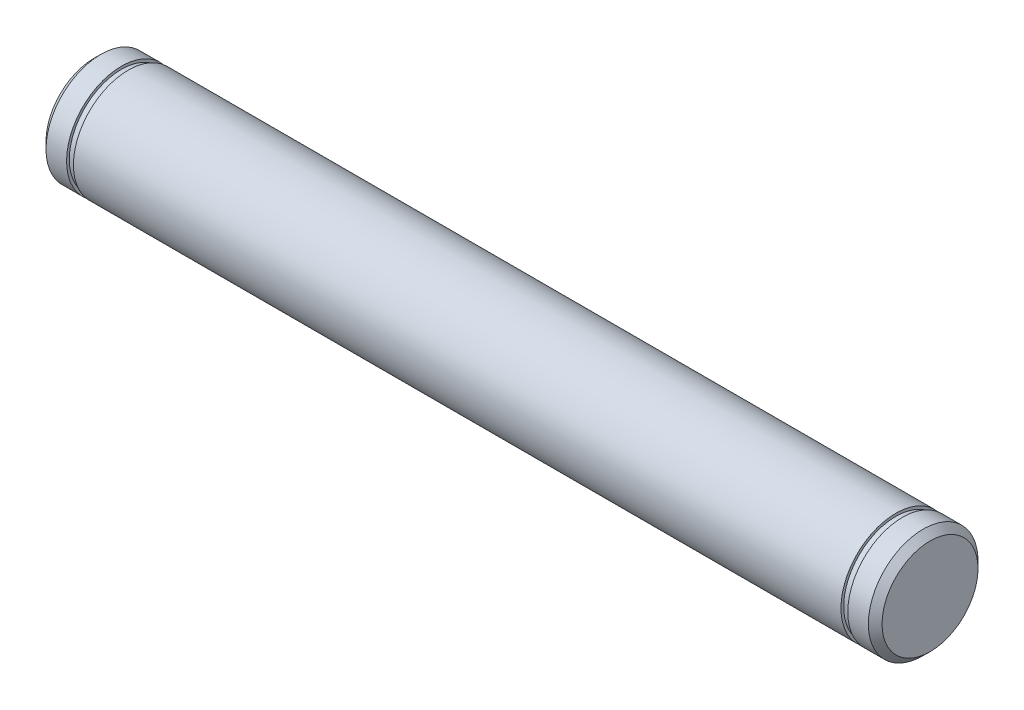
ISO-10303-21;
HEADER;
FILE_DESCRIPTION(('STEP AP214'),'2;1');
FILE_NAME('part.step','',(''),(''),'','','');
FILE_SCHEMA(('AUTOMOTIVE_DESIGN { 1 0 10303 214 1 1 1 1 }'));
ENDSEC;
DATA;
#1=APPLICATION_CONTEXT('core data for automotive mechanical design processes');
#2=APPLICATION_PROTOCOL_DEFINITION('international standard','automotive_design',2000,#1);
#3=PRODUCT_CONTEXT('',#1,'mechanical');
#4=PRODUCT('Part','Part','',(#3));
#5=PRODUCT_RELATED_PRODUCT_CATEGORY('part','',(#4));
#6=PRODUCT_DEFINITION_FORMATION('','',#4);
#7=PRODUCT_DEFINITION_CONTEXT('part definition',#1,'design');
#8=PRODUCT_DEFINITION('design','',#6,#7);
#9=PRODUCT_DEFINITION_SHAPE('','',#8);
#10=(LENGTH_UNIT() NAMED_UNIT(*) SI_UNIT(.MILLI.,.METRE.));
#11=(NAMED_UNIT(*) PLANE_ANGLE_UNIT() SI_UNIT($,.RADIAN.));
#12=(NAMED_UNIT(*) SI_UNIT($,.STERADIAN.) SOLID_ANGLE_UNIT());
#13=UNCERTAINTY_MEASURE_WITH_UNIT(LENGTH_MEASURE(1.E-05),#10,'distance_accuracy_value','');
#14=(GEOMETRIC_REPRESENTATION_CONTEXT(3) GLOBAL_UNCERTAINTY_ASSIGNED_CONTEXT((#13)) GLOBAL_UNIT_ASSIGNED_CONTEXT((#10,
#11,#12)) REPRESENTATION_CONTEXT('',''));
#15=CARTESIAN_POINT('',(0.,0.,0.));
#16=DIRECTION('',(0.,0.,1.));
#17=DIRECTION('',(1.,0.,0.));
#18=AXIS2_PLACEMENT_3D('',#15,#16,#17);
#19=CARTESIAN_POINT('',(30.5,0.,0.));
#20=DIRECTION('',(-1.,0.,0.));
#21=DIRECTION('',(0.,0.,1.));
#22=AXIS2_PLACEMENT_3D('',#19,#20,#21);
#23=CYLINDRICAL_SURFACE('',#22,2.);
#24=CARTESIAN_POINT('',(29.25,0.,0.));
#25=DIRECTION('',(1.,0.,0.));
#26=DIRECTION('',(0.,0.,-1.));
#27=AXIS2_PLACEMENT_3D('',#24,#25,#26);
#28=CIRCLE('',#27,2.);
#29=CARTESIAN_POINT('',(29.25,0.,2.));
#30=VERTEX_POINT('',#29);
#31=EDGE_CURVE('E56',#30,#30,#28,.T.);
#32=CARTESIAN_POINT('',(1.25,0.,0.));
#33=DIRECTION('',(-1.,0.,0.));
#34=DIRECTION('',(0.,0.,1.));
#35=AXIS2_PLACEMENT_3D('',#32,#33,#34);
#36=CIRCLE('',#35,2.);
#37=CARTESIAN_POINT('',(1.25,0.,2.));
#38=VERTEX_POINT('',#37);
#39=EDGE_CURVE('E57',#38,#38,#36,.T.);
#40=CARTESIAN_POINT('',(29.25,0.,2.));
#41=CARTESIAN_POINT('',(28.9583333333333,0.,2.));
#42=CARTESIAN_POINT('',(28.6666666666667,0.,2.));
#43=CARTESIAN_POINT('',(28.0833333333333,0.,2.));
#44=CARTESIAN_POINT('',(27.7916666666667,0.,2.));
#45=CARTESIAN_POINT('',(27.2083333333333,0.,2.));
#46=CARTESIAN_POINT('',(26.9166666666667,0.,2.));
#47=CARTESIAN_POINT('',(26.3333333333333,0.,2.));
#48=CARTESIAN_POINT('',(26.0416666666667,0.,2.));
#49=CARTESIAN_POINT('',(25.4583333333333,0.,2.));
#50=CARTESIAN_POINT('',(25.1666666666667,0.,2.));
#51=CARTESIAN_POINT('',(24.5833333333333,0.,2.));
#52=CARTESIAN_POINT('',(24.2916666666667,0.,2.));
#53=CARTESIAN_POINT('',(23.7083333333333,0.,2.));
#54=CARTESIAN_POINT('',(23.4166666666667,0.,2.));
#55=CARTESIAN_POINT('',(22.8333333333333,0.,2.));
#56=CARTESIAN_POINT('',(22.5416666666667,0.,2.));
#57=CARTESIAN_POINT('',(21.9583333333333,0.,2.));
#58=CARTESIAN_POINT('',(21.6666666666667,0.,2.));
#59=CARTESIAN_POINT('',(21.0833333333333,0.,2.));
#60=CARTESIAN_POINT('',(20.7916666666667,0.,2.));
#61=CARTESIAN_POINT('',(20.2083333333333,0.,2.));
#62=CARTESIAN_POINT('',(19.9166666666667,0.,2.));
#63=CARTESIAN_POINT('',(19.3333333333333,0.,2.));
#64=CARTESIAN_POINT('',(19.0416666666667,0.,2.));
#65=CARTESIAN_POINT('',(18.4583333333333,0.,2.));
#66=CARTESIAN_POINT('',(18.1666666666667,0.,2.));
#67=CARTESIAN_POINT('',(17.5833333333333,0.,2.));
#68=CARTESIAN_POINT('',(17.2916666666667,0.,2.));
#69=CARTESIAN_POINT('',(16.7083333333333,0.,2.));
#70=CARTESIAN_POINT('',(16.4166666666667,0.,2.));
#71=CARTESIAN_POINT('',(15.8333333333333,0.,2.));
#72=CARTESIAN_POINT('',(15.5416666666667,0.,2.));
#73=CARTESIAN_POINT('',(14.9583333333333,0.,2.));
#74=CARTESIAN_POINT('',(14.6666666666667,0.,2.));
#75=CARTESIAN_POINT('',(14.0833333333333,0.,2.));
#76=CARTESIAN_POINT('',(13.7916666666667,0.,2.));
#77=CARTESIAN_POINT('',(13.2083333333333,0.,2.));
#78=CARTESIAN_POINT('',(12.9166666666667,0.,2.));
#79=CARTESIAN_POINT('',(12.3333333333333,0.,2.));
#80=CARTESIAN_POINT('',(12.0416666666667,0.,2.));
#81=CARTESIAN_POINT('',(11.4583333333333,0.,2.));
#82=CARTESIAN_POINT('',(11.1666666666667,0.,2.));
#83=CARTESIAN_POINT('',(10.5833333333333,0.,2.));
#84=CARTESIAN_POINT('',(10.2916666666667,0.,2.));
#85=CARTESIAN_POINT('',(9.70833333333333,0.,2.));
#86=CARTESIAN_POINT('',(9.41666666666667,0.,2.));
#87=CARTESIAN_POINT('',(8.83333333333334,0.,2.));
#88=CARTESIAN_POINT('',(8.54166666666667,0.,2.));
#89=CARTESIAN_POINT('',(7.95833333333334,0.,2.));
#90=CARTESIAN_POINT('',(7.66666666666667,0.,2.));
#91=CARTESIAN_POINT('',(7.08333333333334,0.,2.));
#92=CARTESIAN_POINT('',(6.79166666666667,0.,2.));
#93=CARTESIAN_POINT('',(6.20833333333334,0.,2.));
#94=CARTESIAN_POINT('',(5.91666666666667,0.,2.));
#95=CARTESIAN_POINT('',(5.33333333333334,0.,2.));
#96=CARTESIAN_POINT('',(5.04166666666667,0.,2.));
#97=CARTESIAN_POINT('',(4.45833333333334,0.,2.));
#98=CARTESIAN_POINT('',(4.16666666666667,0.,2.));
#99=CARTESIAN_POINT('',(3.58333333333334,0.,2.));
#100=CARTESIAN_POINT('',(3.29166666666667,0.,2.));
#101=CARTESIAN_POINT('',(2.70833333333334,0.,2.));
#102=CARTESIAN_POINT('',(2.41666666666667,0.,2.));
#103=CARTESIAN_POINT('',(1.83333333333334,0.,2.));
#104=CARTESIAN_POINT('',(1.54166666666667,0.,2.));
#105=CARTESIAN_POINT('',(1.25,0.,2.));
#106=B_SPLINE_CURVE_WITH_KNOTS('',3,(#40,#41,#42,#43,#44,#45,#46,#47,#48,#49,#50,#51,#52,#53,
#54,#55,#56,#57,#58,#59,#60,#61,#62,#63,#64,#65,#66,#67,#68,#69,#70,#71,#72,#73,#74,#75,#76,#77,
#78,#79,#80,#81,#82,#83,#84,#85,#86,#87,#88,#89,#90,#91,#92,#93,#94,#95,#96,#97,#98,#99,#100,
#101,#102,#103,#104,#105),.UNSPECIFIED.,.F.,.F.,(4,2,2,2,2,2,2,2,2,2,2,2,2,2,2,2,2,2,2,2,2,2,2,
2,2,2,2,2,2,2,2,2,4),(0.,0.874999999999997,1.75,2.625,3.5,4.375,5.25,6.12499999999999,7.,7.875,
8.74999999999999,9.62499999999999,10.5,11.375,12.25,13.125,14.,14.875,15.75,16.625,17.5,18.375,
19.25,20.125,21.,21.875,22.75,23.625,24.5,25.375,26.25,27.125,28.),.UNSPECIFIED.);
#107=EDGE_CURVE('BSEAM34',#30,#38,#106,.T.);
#108=ORIENTED_EDGE('',*,*,#31,.F.);
#109=ORIENTED_EDGE('',*,*,#39,.F.);
#110=ORIENTED_EDGE('',*,*,#107,.T.);
#111=ORIENTED_EDGE('',*,*,#107,.F.);
#112=EDGE_LOOP('',(#108,#110,#109,#111));
#113=FACE_BOUND('',#112,.T.);
#114=ADVANCED_FACE('F34',(#113),#23,.T.);
#115=CARTESIAN_POINT('',(29.25,0.,0.));
#116=DIRECTION('',(1.,0.,0.));
#117=DIRECTION('',(0.,0.,-1.));
#118=AXIS2_PLACEMENT_3D('',#115,#116,#117);
#119=PLANE('',#118);
#120=CARTESIAN_POINT('',(29.25,0.,0.));
#121=DIRECTION('',(1.,0.,0.));
#122=DIRECTION('',(0.,0.,-1.));
#123=AXIS2_PLACEMENT_3D('',#120,#121,#122);
#124=CIRCLE('',#123,1.9);
#125=CARTESIAN_POINT('',(29.25,0.,-1.9));
#126=VERTEX_POINT('',#125);
#127=EDGE_CURVE('E72',#126,#126,#124,.T.);
#128=ORIENTED_EDGE('',*,*,#127,.F.);
#129=EDGE_LOOP('',(#128));
#130=FACE_BOUND('',#129,.T.);
#131=ORIENTED_EDGE('',*,*,#31,.T.);
#132=EDGE_LOOP('',(#131));
#133=FACE_BOUND('',#132,.T.);
#134=ADVANCED_FACE('F97',(#130,#133),#119,.T.);
#135=CARTESIAN_POINT('',(29.5,0.,0.));
#136=DIRECTION('',(1.,0.,0.));
#137=DIRECTION('',(0.,0.,-1.));
#138=AXIS2_PLACEMENT_3D('',#135,#136,#137);
#139=PLANE('',#138);
#140=CARTESIAN_POINT('',(29.5,0.,0.));
#141=DIRECTION('',(1.,0.,0.));
#142=DIRECTION('',(0.,0.,-1.));
#143=AXIS2_PLACEMENT_3D('',#140,#141,#142);
#144=CIRCLE('',#143,1.9);
#145=CARTESIAN_POINT('',(29.5,0.,-1.9));
#146=VERTEX_POINT('',#145);
#147=EDGE_CURVE('E61',#146,#146,#144,.T.);
#148=ORIENTED_EDGE('',*,*,#147,.T.);
#149=EDGE_LOOP('',(#148));
#150=FACE_BOUND('',#149,.T.);
#151=CARTESIAN_POINT('',(29.5,0.,0.));
#152=DIRECTION('',(1.,0.,0.));
#153=DIRECTION('',(0.,0.,-1.));
#154=AXIS2_PLACEMENT_3D('',#151,#152,#153);
#155=CIRCLE('',#154,2.);
#156=CARTESIAN_POINT('',(29.5,0.,2.));
#157=VERTEX_POINT('',#156);
#158=EDGE_CURVE('E69',#157,#157,#155,.T.);
#159=ORIENTED_EDGE('',*,*,#158,.F.);
#160=EDGE_LOOP('',(#159));
#161=FACE_BOUND('',#160,.T.);
#162=ADVANCED_FACE('F104',(#150,#161),#139,.F.);
#163=CARTESIAN_POINT('',(29.25,0.,0.));
#164=DIRECTION('',(1.,0.,0.));
#165=DIRECTION('',(0.,0.,-1.));
#166=AXIS2_PLACEMENT_3D('',#163,#164,#165);
#167=CYLINDRICAL_SURFACE('',#166,1.9);
#168=ORIENTED_EDGE('',*,*,#127,.T.);
#169=EDGE_LOOP('',(#168));
#170=FACE_BOUND('',#169,.T.);
#171=ORIENTED_EDGE('',*,*,#147,.F.);
#172=EDGE_LOOP('',(#171));
#173=FACE_BOUND('',#172,.T.);
#174=ADVANCED_FACE('F118',(#170,#173),#167,.T.);
#175=CARTESIAN_POINT('',(30.5,0.,0.));
#176=DIRECTION('',(1.,0.,0.));
#177=DIRECTION('',(0.,0.,-1.));
#178=AXIS2_PLACEMENT_3D('',#175,#176,#177);
#179=PLANE('',#178);
#180=CARTESIAN_POINT('',(30.5,0.,0.));
#181=DIRECTION('',(1.,0.,0.));
#182=DIRECTION('',(0.,0.,-1.));
#183=AXIS2_PLACEMENT_3D('',#180,#181,#182);
#184=CIRCLE('',#183,1.75000000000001);
#185=CARTESIAN_POINT('',(30.5,0.,-1.75000000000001));
#186=VERTEX_POINT('',#185);
#187=EDGE_CURVE('E41',#186,#186,#184,.T.);
#188=ORIENTED_EDGE('',*,*,#187,.T.);
#189=EDGE_LOOP('',(#188));
#190=FACE_BOUND('',#189,.T.);
#191=ADVANCED_FACE('F114',(#190),#179,.T.);
#192=CARTESIAN_POINT('',(30.25,0.,0.));
#193=DIRECTION('',(1.,0.,0.));
#194=DIRECTION('',(0.,0.,-1.));
#195=AXIS2_PLACEMENT_3D('',#192,#193,#194);
#196=CIRCLE('',#195,2.);
#197=CARTESIAN_POINT('',(30.25,0.,2.));
#198=VERTEX_POINT('',#197);
#199=EDGE_CURVE('E10',#198,#198,#196,.F.);
#200=CARTESIAN_POINT('',(30.25,0.,2.));
#201=CARTESIAN_POINT('',(30.2421875,0.,2.));
#202=CARTESIAN_POINT('',(30.234375,0.,2.));
#203=CARTESIAN_POINT('',(30.21875,0.,2.));
#204=CARTESIAN_POINT('',(30.2109375,0.,2.));
#205=CARTESIAN_POINT('',(30.1953125,0.,2.));
#206=CARTESIAN_POINT('',(30.1875,0.,2.));
#207=CARTESIAN_POINT('',(30.171875,0.,2.));
#208=CARTESIAN_POINT('',(30.1640625,0.,2.));
#209=CARTESIAN_POINT('',(30.1484375,0.,2.));
#210=CARTESIAN_POINT('',(30.140625,0.,2.));
#211=CARTESIAN_POINT('',(30.125,0.,2.));
#212=CARTESIAN_POINT('',(30.1171875,0.,2.));
#213=CARTESIAN_POINT('',(30.1015625,0.,2.));
#214=CARTESIAN_POINT('',(30.09375,0.,2.));
#215=CARTESIAN_POINT('',(30.078125,0.,2.));
#216=CARTESIAN_POINT('',(30.0703125,0.,2.));
#217=CARTESIAN_POINT('',(30.0546875,0.,2.));
#218=CARTESIAN_POINT('',(30.046875,0.,2.));
#219=CARTESIAN_POINT('',(30.03125,0.,2.));
#220=CARTESIAN_POINT('',(30.0234375,0.,2.));
#221=CARTESIAN_POINT('',(30.0078125,0.,2.));
#222=CARTESIAN_POINT('',(30.,0.,2.));
#223=CARTESIAN_POINT('',(29.984375,0.,2.));
#224=CARTESIAN_POINT('',(29.9765625,0.,2.));
#225=CARTESIAN_POINT('',(29.9609375,0.,2.));
#226=CARTESIAN_POINT('',(29.953125,0.,2.));
#227=CARTESIAN_POINT('',(29.9375,0.,2.));
#228=CARTESIAN_POINT('',(29.9296875,0.,2.));
#229=CARTESIAN_POINT('',(29.9140625,0.,2.));
#230=CARTESIAN_POINT('',(29.90625,0.,2.));
#231=CARTESIAN_POINT('',(29.890625,0.,2.));
#232=CARTESIAN_POINT('',(29.8828125,0.,2.));
#233=CARTESIAN_POINT('',(29.8671875,0.,2.));
#234=CARTESIAN_POINT('',(29.859375,0.,2.));
#235=CARTESIAN_POINT('',(29.84375,0.,2.));
#236=CARTESIAN_POINT('',(29.8359375,0.,2.));
#237=CARTESIAN_POINT('',(29.8203125,0.,2.));
#238=CARTESIAN_POINT('',(29.8125,0.,2.));
#239=CARTESIAN_POINT('',(29.796875,0.,2.));
#240=CARTESIAN_POINT('',(29.7890625,0.,2.));
#241=CARTESIAN_POINT('',(29.7734375,0.,2.));
#242=CARTESIAN_POINT('',(29.765625,0.,2.));
#243=CARTESIAN_POINT('',(29.75,0.,2.));
#244=CARTESIAN_POINT('',(29.7421875,0.,2.));
#245=CARTESIAN_POINT('',(29.7265625,0.,2.));
#246=CARTESIAN_POINT('',(29.71875,0.,2.));
#247=CARTESIAN_POINT('',(29.703125,0.,2.));
#248=CARTESIAN_POINT('',(29.6953125,0.,2.));
#249=CARTESIAN_POINT('',(29.6796875,0.,2.));
#250=CARTESIAN_POINT('',(29.671875,0.,2.));
#251=CARTESIAN_POINT('',(29.65625,0.,2.));
#252=CARTESIAN_POINT('',(29.6484375,0.,2.));
#253=CARTESIAN_POINT('',(29.6328125,0.,2.));
#254=CARTESIAN_POINT('',(29.625,0.,2.));
#255=CARTESIAN_POINT('',(29.609375,0.,2.));
#256=CARTESIAN_POINT('',(29.6015625,0.,2.));
#257=CARTESIAN_POINT('',(29.5859375,0.,2.));
#258=CARTESIAN_POINT('',(29.578125,0.,2.));
#259=CARTESIAN_POINT('',(29.5625,0.,2.));
#260=CARTESIAN_POINT('',(29.5546875,0.,2.));
#261=CARTESIAN_POINT('',(29.5390625,0.,2.));
#262=CARTESIAN_POINT('',(29.53125,0.,2.));
#263=CARTESIAN_POINT('',(29.515625,0.,2.));
#264=CARTESIAN_POINT('',(29.5078125,0.,2.));
#265=CARTESIAN_POINT('',(29.5,0.,2.));
#266=B_SPLINE_CURVE_WITH_KNOTS('',3,(#200,#201,#202,#203,#204,#205,#206,#207,#208,#209,#210,
#211,#212,#213,#214,#215,#216,#217,#218,#219,#220,#221,#222,#223,#224,#225,#226,#227,#228,#229,
#230,#231,#232,#233,#234,#235,#236,#237,#238,#239,#240,#241,#242,#243,#244,#245,#246,#247,#248,
#249,#250,#251,#252,#253,#254,#255,#256,#257,#258,#259,#260,#261,#262,#263,#264,#265),
.UNSPECIFIED.,.F.,.F.,(4,2,2,2,2,2,2,2,2,2,2,2,2,2,2,2,2,2,2,2,2,2,2,2,2,2,2,2,2,2,2,2,4),(0.,
0.0234374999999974,0.0468749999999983,0.0703124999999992,0.0937500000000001,0.117187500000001,
0.140624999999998,0.164062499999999,0.1875,0.210937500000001,0.234375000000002,
0.257812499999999,0.28125,0.304687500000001,0.328125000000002,0.351562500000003,
0.375000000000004,0.398437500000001,0.421875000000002,0.445312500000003,0.468750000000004,
0.492187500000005,0.515625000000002,0.539062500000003,0.562500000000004,0.585937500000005,
0.609375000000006,0.632812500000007,0.656250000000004,0.679687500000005,0.703125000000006,
0.726562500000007,0.750000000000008),.UNSPECIFIED.);
#267=EDGE_CURVE('BSEAM92',#198,#157,#266,.T.);
#268=ORIENTED_EDGE('',*,*,#199,.T.);
#269=ORIENTED_EDGE('',*,*,#158,.T.);
#270=ORIENTED_EDGE('',*,*,#267,.T.);
#271=ORIENTED_EDGE('',*,*,#267,.F.);
#272=EDGE_LOOP('',(#268,#270,#269,#271));
#273=FACE_BOUND('',#272,.T.);
#274=ADVANCED_FACE('F92',(#273),#23,.T.);
#275=CARTESIAN_POINT('',(1.25,0.,0.));
#276=DIRECTION('',(-1.,0.,0.));
#277=DIRECTION('',(0.,0.,1.));
#278=AXIS2_PLACEMENT_3D('',#275,#276,#277);
#279=PLANE('',#278);
#280=CARTESIAN_POINT('',(1.25,0.,0.));
#281=DIRECTION('',(-1.,0.,0.));
#282=DIRECTION('',(0.,0.,1.));
#283=AXIS2_PLACEMENT_3D('',#280,#281,#282);
#284=CIRCLE('',#283,1.9);
#285=CARTESIAN_POINT('',(1.25,0.,1.9));
#286=VERTEX_POINT('',#285);
#287=EDGE_CURVE('E66',#286,#286,#284,.T.);
#288=ORIENTED_EDGE('',*,*,#287,.F.);
#289=EDGE_LOOP('',(#288));
#290=FACE_BOUND('',#289,.T.);
#291=ORIENTED_EDGE('',*,*,#39,.T.);
#292=EDGE_LOOP('',(#291));
#293=FACE_BOUND('',#292,.T.);
#294=ADVANCED_FACE('F88',(#290,#293),#279,.T.);
#295=CARTESIAN_POINT('',(1.,0.,0.));
#296=DIRECTION('',(-1.,0.,0.));
#297=DIRECTION('',(0.,0.,1.));
#298=AXIS2_PLACEMENT_3D('',#295,#296,#297);
#299=PLANE('',#298);
#300=CARTESIAN_POINT('',(1.,0.,0.));
#301=DIRECTION('',(-1.,0.,0.));
#302=DIRECTION('',(0.,0.,1.));
#303=AXIS2_PLACEMENT_3D('',#300,#301,#302);
#304=CIRCLE('',#303,1.9);
#305=CARTESIAN_POINT('',(1.,0.,1.9));
#306=VERTEX_POINT('',#305);
#307=EDGE_CURVE('E77',#306,#306,#304,.T.);
#308=ORIENTED_EDGE('',*,*,#307,.T.);
#309=EDGE_LOOP('',(#308));
#310=FACE_BOUND('',#309,.T.);
#311=CARTESIAN_POINT('',(1.,0.,0.));
#312=DIRECTION('',(-1.,0.,0.));
#313=DIRECTION('',(0.,0.,1.));
#314=AXIS2_PLACEMENT_3D('',#311,#312,#313);
#315=CIRCLE('',#314,2.);
#316=CARTESIAN_POINT('',(1.,0.,2.));
#317=VERTEX_POINT('',#316);
#318=EDGE_CURVE('E62',#317,#317,#315,.T.);
#319=ORIENTED_EDGE('',*,*,#318,.F.);
#320=EDGE_LOOP('',(#319));
#321=FACE_BOUND('',#320,.T.);
#322=ADVANCED_FACE('F91',(#310,#321),#299,.F.);
#323=CARTESIAN_POINT('',(1.25,0.,0.));
#324=DIRECTION('',(-1.,0.,0.));
#325=DIRECTION('',(0.,0.,1.));
#326=AXIS2_PLACEMENT_3D('',#323,#324,#325);
#327=CYLINDRICAL_SURFACE('',#326,1.9);
#328=ORIENTED_EDGE('',*,*,#287,.T.);
#329=EDGE_LOOP('',(#328));
#330=FACE_BOUND('',#329,.T.);
#331=ORIENTED_EDGE('',*,*,#307,.F.);
#332=EDGE_LOOP('',(#331));
#333=FACE_BOUND('',#332,.T.);
#334=ADVANCED_FACE('F85',(#330,#333),#327,.T.);
#335=CARTESIAN_POINT('',(0.,0.,0.));
#336=DIRECTION('',(1.,0.,0.));
#337=DIRECTION('',(0.,0.,-1.));
#338=AXIS2_PLACEMENT_3D('',#335,#336,#337);
#339=PLANE('',#338);
#340=CARTESIAN_POINT('',(0.,0.,0.));
#341=DIRECTION('',(1.,0.,0.));
#342=DIRECTION('',(0.,0.,-1.));
#343=AXIS2_PLACEMENT_3D('',#340,#341,#342);
#344=CIRCLE('',#343,1.74999999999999);
#345=CARTESIAN_POINT('',(0.,0.,-1.74999999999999));
#346=VERTEX_POINT('',#345);
#347=EDGE_CURVE('E45',#346,#346,#344,.F.);
#348=ORIENTED_EDGE('',*,*,#347,.T.);
#349=EDGE_LOOP('',(#348));
#350=FACE_BOUND('',#349,.T.);
#351=ADVANCED_FACE('F111',(#350),#339,.F.);
#352=CARTESIAN_POINT('',(0.250000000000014,0.,0.));
#353=DIRECTION('',(1.,0.,0.));
#354=DIRECTION('',(0.,0.,-1.));
#355=AXIS2_PLACEMENT_3D('',#352,#353,#354);
#356=CIRCLE('',#355,2.);
#357=CARTESIAN_POINT('',(0.250000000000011,0.,2.));
#358=VERTEX_POINT('',#357);
#359=EDGE_CURVE('E50',#358,#358,#356,.T.);
#360=CARTESIAN_POINT('',(0.250000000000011,0.,2.));
#361=CARTESIAN_POINT('',(0.257812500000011,0.,2.));
#362=CARTESIAN_POINT('',(0.265625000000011,0.,2.));
#363=CARTESIAN_POINT('',(0.281250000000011,0.,2.));
#364=CARTESIAN_POINT('',(0.28906250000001,0.,2.));
#365=CARTESIAN_POINT('',(0.304687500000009,0.,2.));
#366=CARTESIAN_POINT('',(0.31250000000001,0.,2.));
#367=CARTESIAN_POINT('',(0.32812500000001,0.,2.));
#368=CARTESIAN_POINT('',(0.33593750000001,0.,2.));
#369=CARTESIAN_POINT('',(0.35156250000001,0.,2.));
#370=CARTESIAN_POINT('',(0.359375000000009,0.,2.));
#371=CARTESIAN_POINT('',(0.375000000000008,0.,2.));
#372=CARTESIAN_POINT('',(0.382812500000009,0.,2.));
#373=CARTESIAN_POINT('',(0.398437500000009,0.,2.));
#374=CARTESIAN_POINT('',(0.40625000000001,0.,2.));
#375=CARTESIAN_POINT('',(0.42187500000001,0.,2.));
#376=CARTESIAN_POINT('',(0.42968750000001,0.,2.));
#377=CARTESIAN_POINT('',(0.44531250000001,0.,2.));
#378=CARTESIAN_POINT('',(0.453125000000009,0.,2.));
#379=CARTESIAN_POINT('',(0.468750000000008,0.,2.));
#380=CARTESIAN_POINT('',(0.476562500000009,0.,2.));
#381=CARTESIAN_POINT('',(0.492187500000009,0.,2.));
#382=CARTESIAN_POINT('',(0.50000000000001,0.,2.));
#383=CARTESIAN_POINT('',(0.515625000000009,0.,2.));
#384=CARTESIAN_POINT('',(0.523437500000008,0.,2.));
#385=CARTESIAN_POINT('',(0.539062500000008,0.,2.));
#386=CARTESIAN_POINT('',(0.546875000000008,0.,2.));
#387=CARTESIAN_POINT('',(0.562500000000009,0.,2.));
#388=CARTESIAN_POINT('',(0.570312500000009,0.,2.));
#389=CARTESIAN_POINT('',(0.585937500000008,0.,2.));
#390=CARTESIAN_POINT('',(0.593750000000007,0.,2.));
#391=CARTESIAN_POINT('',(0.609375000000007,0.,2.));
#392=CARTESIAN_POINT('',(0.617187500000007,0.,2.));
#393=CARTESIAN_POINT('',(0.632812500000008,0.,2.));
#394=CARTESIAN_POINT('',(0.640625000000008,0.,2.));
#395=CARTESIAN_POINT('',(0.656250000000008,0.,2.));
#396=CARTESIAN_POINT('',(0.664062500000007,0.,2.));
#397=CARTESIAN_POINT('',(0.679687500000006,0.,2.));
#398=CARTESIAN_POINT('',(0.687500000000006,0.,2.));
#399=CARTESIAN_POINT('',(0.703125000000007,0.,2.));
#400=CARTESIAN_POINT('',(0.710937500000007,0.,2.));
#401=CARTESIAN_POINT('',(0.726562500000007,0.,2.));
#402=CARTESIAN_POINT('',(0.734375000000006,0.,2.));
#403=CARTESIAN_POINT('',(0.750000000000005,0.,2.));
#404=CARTESIAN_POINT('',(0.757812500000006,0.,2.));
#405=CARTESIAN_POINT('',(0.773437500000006,0.,2.));
#406=CARTESIAN_POINT('',(0.781250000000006,0.,2.));
#407=CARTESIAN_POINT('',(0.796875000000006,0.,2.));
#408=CARTESIAN_POINT('',(0.804687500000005,0.,2.));
#409=CARTESIAN_POINT('',(0.820312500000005,0.,2.));
#410=CARTESIAN_POINT('',(0.828125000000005,0.,2.));
#411=CARTESIAN_POINT('',(0.843750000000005,0.,2.));
#412=CARTESIAN_POINT('',(0.851562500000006,0.,2.));
#413=CARTESIAN_POINT('',(0.867187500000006,0.,2.));
#414=CARTESIAN_POINT('',(0.875000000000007,0.,2.));
#415=CARTESIAN_POINT('',(0.890625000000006,0.,2.));
#416=CARTESIAN_POINT('',(0.898437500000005,0.,2.));
#417=CARTESIAN_POINT('',(0.914062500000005,0.,2.));
#418=CARTESIAN_POINT('',(0.921875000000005,0.,2.));
#419=CARTESIAN_POINT('',(0.937500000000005,0.,2.));
#420=CARTESIAN_POINT('',(0.945312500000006,0.,2.));
#421=CARTESIAN_POINT('',(0.960937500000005,0.,2.));
#422=CARTESIAN_POINT('',(0.968750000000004,0.,2.));
#423=CARTESIAN_POINT('',(0.984375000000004,0.,2.));
#424=CARTESIAN_POINT('',(0.992187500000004,0.,2.));
#425=CARTESIAN_POINT('',(1.,0.,2.));
#426=B_SPLINE_CURVE_WITH_KNOTS('',3,(#360,#361,#362,#363,#364,#365,#366,#367,#368,#369,#370,
#371,#372,#373,#374,#375,#376,#377,#378,#379,#380,#381,#382,#383,#384,#385,#386,#387,#388,#389,
#390,#391,#392,#393,#394,#395,#396,#397,#398,#399,#400,#401,#402,#403,#404,#405,#406,#407,#408,
#409,#410,#411,#412,#413,#414,#415,#416,#417,#418,#419,#420,#421,#422,#423,#424,#425),
.UNSPECIFIED.,.F.,.F.,(4,2,2,2,2,2,2,2,2,2,2,2,2,2,2,2,2,2,2,2,2,2,2,2,2,2,2,2,2,2,2,2,4),(0.,
0.0234375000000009,0.0468749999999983,0.0703124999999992,0.0937500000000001,0.117187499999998,
0.140624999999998,0.164062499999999,0.1875,0.210937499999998,0.234374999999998,
0.257812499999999,0.281249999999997,0.304687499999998,0.328124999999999,0.351562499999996,
0.374999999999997,0.398437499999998,0.421874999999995,0.445312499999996,0.468749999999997,
0.492187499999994,0.515624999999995,0.539062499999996,0.562499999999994,0.585937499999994,
0.609374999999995,0.632812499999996,0.656249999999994,0.679687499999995,0.703124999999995,
0.726562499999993,0.749999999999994),.UNSPECIFIED.);
#427=EDGE_CURVE('BSEAM100',#358,#317,#426,.T.);
#428=ORIENTED_EDGE('',*,*,#359,.T.);
#429=ORIENTED_EDGE('',*,*,#318,.T.);
#430=ORIENTED_EDGE('',*,*,#427,.T.);
#431=ORIENTED_EDGE('',*,*,#427,.F.);
#432=EDGE_LOOP('',(#428,#430,#429,#431));
#433=FACE_BOUND('',#432,.T.);
#434=ADVANCED_FACE('F100',(#433),#23,.T.);
#435=CARTESIAN_POINT('',(0.250000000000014,0.,0.));
#436=DIRECTION('',(1.,0.,0.));
#437=DIRECTION('',(0.,0.,-1.));
#438=AXIS2_PLACEMENT_3D('',#435,#436,#437);
#439=CONICAL_SURFACE('',#438,2.,0.785398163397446);
#440=ORIENTED_EDGE('',*,*,#347,.F.);
#441=EDGE_LOOP('',(#440));
#442=FACE_BOUND('',#441,.T.);
#443=ORIENTED_EDGE('',*,*,#359,.F.);
#444=EDGE_LOOP('',(#443));
#445=FACE_BOUND('',#444,.T.);
#446=ADVANCED_FACE('F110',(#442,#445),#439,.T.);
#447=CARTESIAN_POINT('',(30.5,0.,0.));
#448=DIRECTION('',(-1.,0.,0.));
#449=DIRECTION('',(0.,0.,1.));
#450=AXIS2_PLACEMENT_3D('',#447,#448,#449);
#451=CONICAL_SURFACE('',#450,1.75000000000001,0.785398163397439);
#452=ORIENTED_EDGE('',*,*,#199,.F.);
#453=EDGE_LOOP('',(#452));
#454=FACE_BOUND('',#453,.T.);
#455=ORIENTED_EDGE('',*,*,#187,.F.);
#456=EDGE_LOOP('',(#455));
#457=FACE_BOUND('',#456,.T.);
#458=ADVANCED_FACE('F36',(#454,#457),#451,.T.);
#459=CLOSED_SHELL('',(#114,#134,#162,#174,#191,#274,#294,#322,#334,#351,#434,#446,#458));
#460=MANIFOLD_SOLID_BREP('B2',#459);
#461=ADVANCED_BREP_SHAPE_REPRESENTATION('',(#18,#460),#14);
#462=SHAPE_DEFINITION_REPRESENTATION(#9,#461);
ENDSEC;
END-ISO-10303-21;
